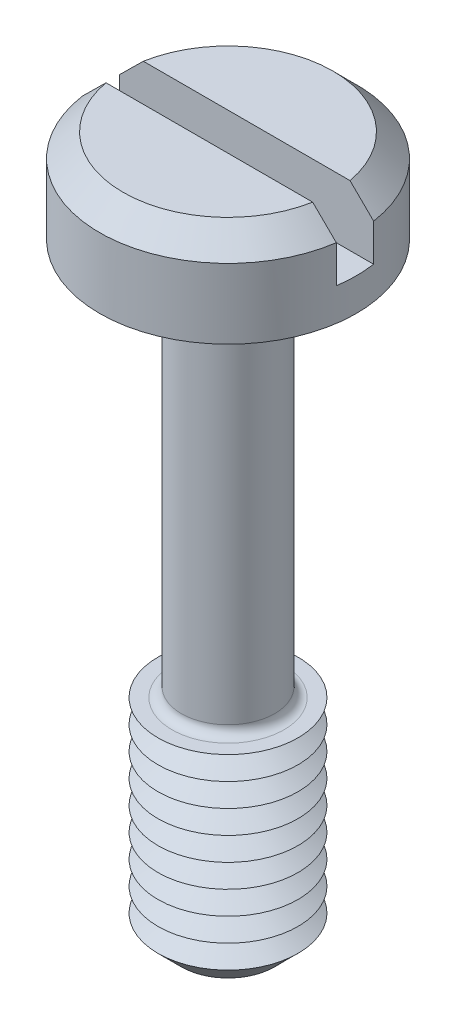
from build123d import *

# Parameters (mm, degrees)
SKETCH1_R           = 2.75
BOSS_EXTRUDE1_DEPTH = 2
SKETCH2_R           = 1
BOSS_EXTRUDE2_DEPTH = 13
SKETCH3_R           = 1.5
BOSS_EXTRUDE3_DEPTH = 4.5
CHAMFER1_SIZE       = 0.5
LPATTERN1_COUNT     = 8
LPATTERN1_PITCH     = 0.5
FILLET1_R           = 0.2
CHAMFER2_SIZE       = 0.5
SKETCH6_W           = 5.5
SKETCH6_H           = 0.8
CUT_EXTRUDE1_DEPTH  = 1.3


with BuildPart() as part:
    # Sketch1 → Boss-Extrude1 (new body)
    with BuildSketch(Plane(origin=(0, 0, 0), x_dir=(1, 0, 0), z_dir=(0, 1, 0))):
        with Locations(Location((0, 0, 0), (0, 0, 270))):
            Circle(SKETCH1_R)
    extrude(amount=BOSS_EXTRUDE1_DEPTH)

    # Sketch2 → Boss-Extrude2 (add)
    with BuildSketch(Plane.XZ):
        with Locations(Location((0, 0, 0), (0, 0, 90))):
            Circle(SKETCH2_R)
    extrude(amount=BOSS_EXTRUDE2_DEPTH)

    # Sketch3 → Boss-Extrude3 (add)
    with BuildSketch(Plane.XZ.offset(13)):
        with Locations(Location((0, 0, 0), (0, 0, 270))):
            Circle(SKETCH3_R)
    extrude(amount=-BOSS_EXTRUDE3_DEPTH)

    # Chamfer1
    chamfer1_edges = [part.edges().sort_by_distance(p)[0] for p in [
        (0, -13, 1.5),
    ]]
    chamfer(chamfer1_edges, length=CHAMFER1_SIZE)

    # Sketch5 → Cut-Revolve1 (revolve, cut)
    with BuildSketch(Plane(origin=(0, 0, 0), x_dir=(0, 0, -1), z_dir=(1, 0, 0))):
        Polygon((-1.5, -8.5), (-1.066987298, -8.75), (-1.5, -9), align=None)
    cut_revolve1 = revolve(axis=Axis((0, -6.58711856, 0), (0, -1, 0)), mode=Mode.SUBTRACT)

    # LPattern1: Cut-Revolve1 ×8
    with Locations(*[(0, -i * LPATTERN1_PITCH, 0) for i in range(1, LPATTERN1_COUNT)]):
        add(cut_revolve1, mode=Mode.SUBTRACT)

    # Fillet1
    fillet1_edges = [part.edges().sort_by_distance(p)[0] for p in [
        (0, 0, -1),
        (0, -8.5, -1),
    ]]
    fillet(fillet1_edges, radius=FILLET1_R)

    # Chamfer2
    chamfer2_edges = [part.edges().sort_by_distance(p)[0] for p in [
        (0, 2, -2.75),
    ]]
    chamfer(chamfer2_edges, length=CHAMFER2_SIZE)

    # Sketch6 → Cut-Extrude1 (cut)
    with BuildSketch(Plane(origin=(0, 2, 0), x_dir=(1, 0, 0), z_dir=(0, 1, 0))):
        Rectangle(SKETCH6_W, SKETCH6_H)
    extrude(amount=-CUT_EXTRUDE1_DEPTH, mode=Mode.SUBTRACT)


solid = part.part
